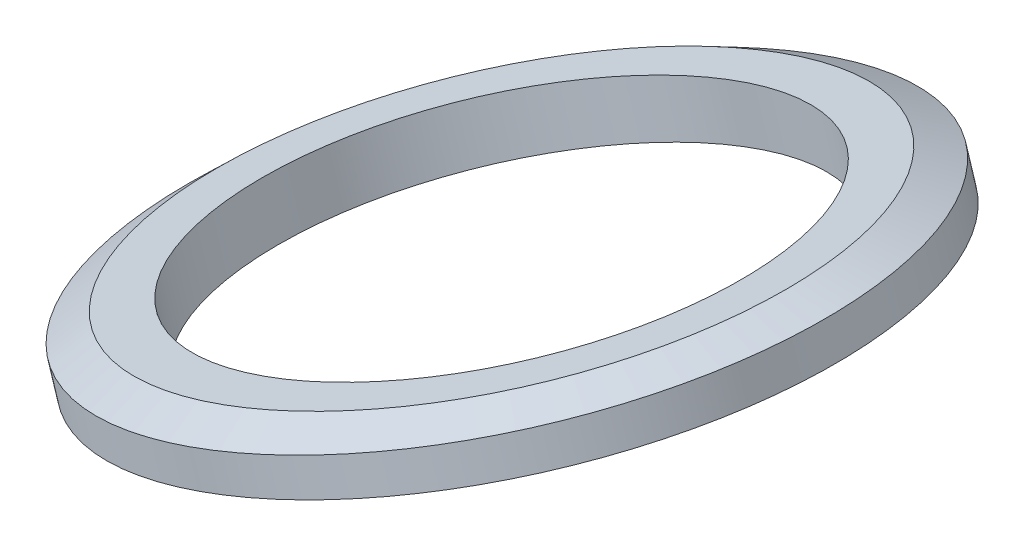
from build123d import *


with BuildPart() as part:
    # Sk_Cono → Cono (revolve)
    with BuildSketch(Plane.XY, mode=Mode.PRIVATE) as cono_sk:
        Polygon((422.135970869, 400.541358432), (424.710999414, 401.353286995), (426.919142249, 401.001001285), (427.520570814, 399.093572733), (423.038113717, 397.680215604), align=None)
    revolve(cono_sk.sketch.rotate(Axis((406.994285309, 401.00971557, 0), (0.3007142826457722, -0.9537142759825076, 0)), 180), axis=Axis((406.994285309, 401.00971557, 0), (0.3007142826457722, -0.9537142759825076, 0)))


solid = part.part
